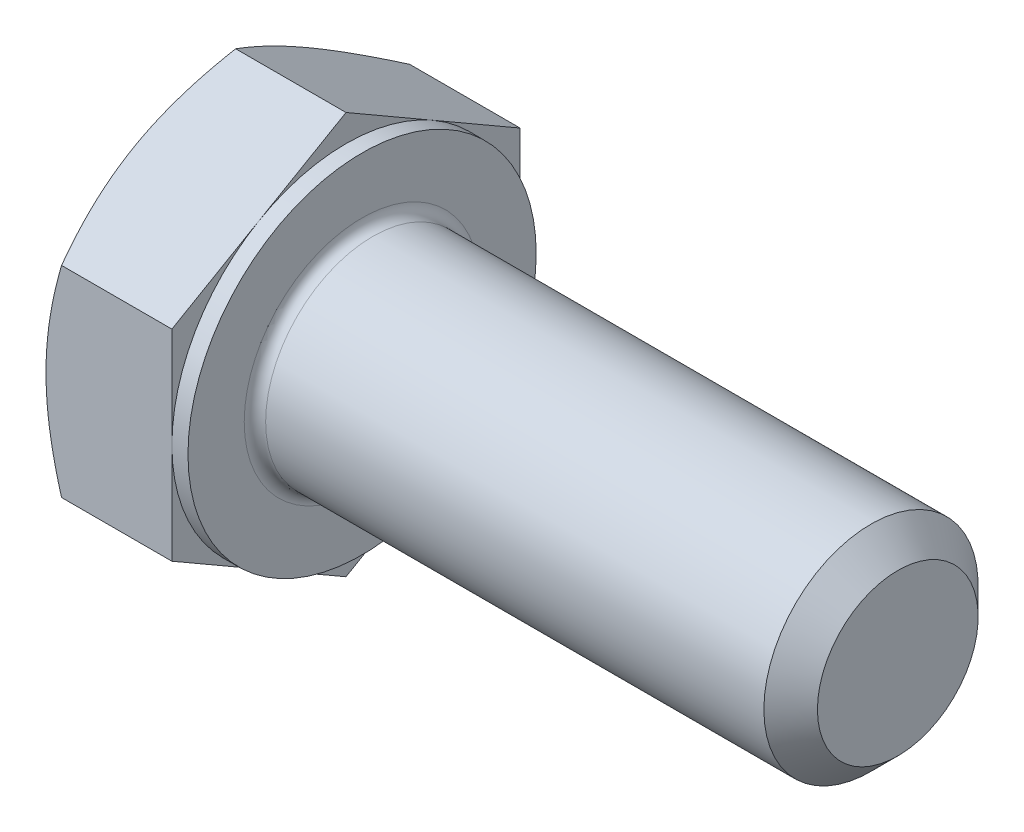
from build123d import *

# Parameters (mm, degrees)
EXTRUDE_358_DEPTH = 5.3
SKETCH_4_W        = 0.6
SKETCH_4_H        = 11.005553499
CHAMFER_1883_SIZE = 1
FILLET_1928_R     = 0.4


with BuildPart() as part:
    # Sketch 1 → Extrude 358 (new body)
    with BuildSketch(Plane(origin=(0, 0, 0), x_dir=(0, 0, -1), z_dir=(1, 0, 0))):
        Polygon((6.5, 3.75277675), (6.5, -3.75277675), (0, -7.505553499), (-6.5, -3.75277675), (-6.5, 3.75277675), (0, 7.505553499), align=None)
    extrude(amount=EXTRUDE_358_DEPTH)

    # Sketch 2 → Revolve 1 (revolve)
    with BuildSketch(Plane.XY, mode=Mode.PRIVATE) as revolve_1_sk:
        Polygon((0, 0), (25.3, 0), (25.3, 2.9175), (25.3, 4), (0, 4), align=None)
    revolve(revolve_1_sk.sketch.rotate(Axis((0, 0, 0), (1, 0, 0)), 90), axis=Axis((0, 0, 0), (1, 0, 0)))

    # Sketch 3 → Cut-Revolve 1 (revolve, cut)
    with BuildSketch(Plane.XY):
        Polygon((0, 6.5), (3.46730793, 12.505553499), (3.46730793, 17.505553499), (-10, 17.505553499), (-10, 6.5), align=None)
    revolve(axis=Axis((0, 0, 0), (1, 0, 0)), mode=Mode.SUBTRACT)

    # Sketch 5 → Cut-Revolve 2 (revolve, cut)
    with BuildSketch(Plane.XY):
        Polygon((5.3, 6.5), (1.83269207, 12.505553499), (1.83269207, 17.505553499), (11.83269207, 17.505553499), (11.83269207, 6.5), align=None)
    revolve(axis=Axis((0, 0, 0), (1, 0, 0)), mode=Mode.SUBTRACT)

    # Sketch 4 → Cut-Revolve 3 (revolve, cut)
    with BuildSketch(Plane.XY, mode=Mode.PRIVATE) as cut_revolve_3_sk:
        with Locations((5, 12.00277675)):
            Rectangle(SKETCH_4_W, SKETCH_4_H)
    revolve(cut_revolve_3_sk.sketch.rotate(Axis((0, 0, 0), (1, 0, 0)), 270), axis=Axis((0, 0, 0), (1, 0, 0)), mode=Mode.SUBTRACT)

    # Chamfer 1883
    chamfer_1883_edges = [part.edges().sort_by_distance(p)[0] for p in [
        (25.3, 0, -4),
    ]]
    chamfer(chamfer_1883_edges, length=CHAMFER_1883_SIZE)

    # Fillet 1928
    fillet_1928_edges = [part.edges().sort_by_distance(p)[0] for p in [
        (5.3, 0, -4),
    ]]
    fillet(fillet_1928_edges, radius=FILLET_1928_R)


solid = part.part
